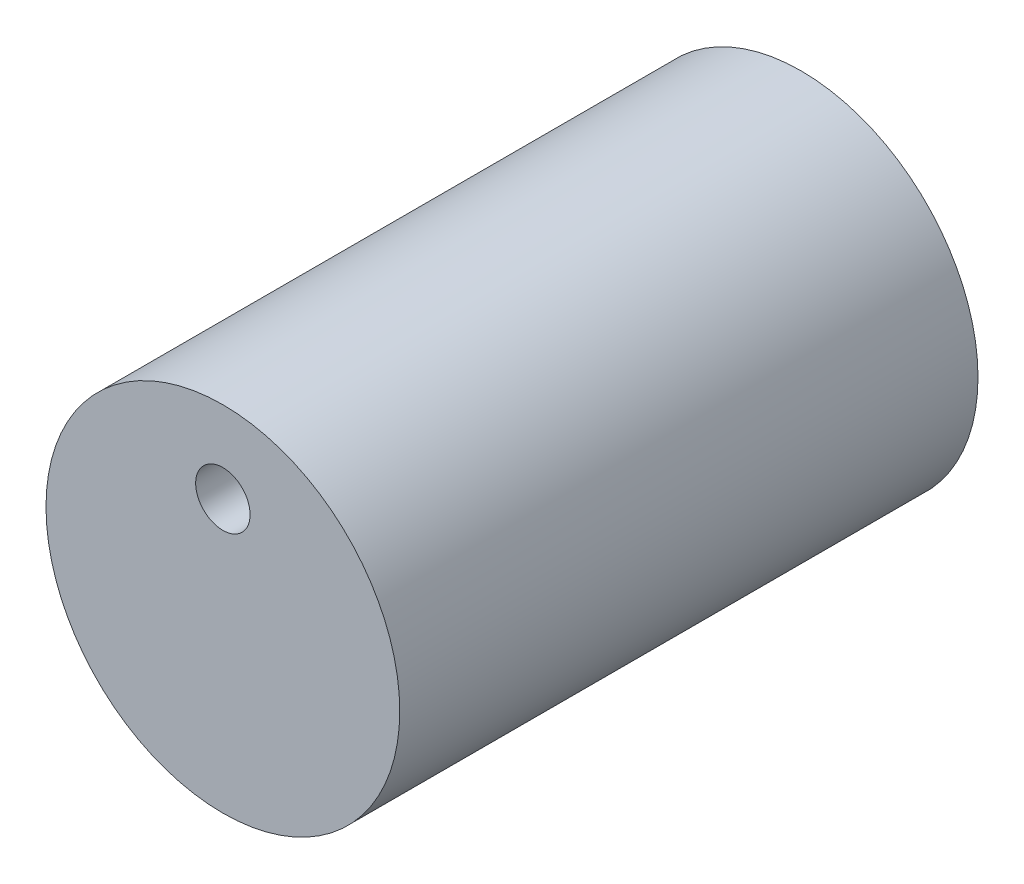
from build123d import *

# Parameters (mm, degrees)
SKETCH_1_R          = 13
EXTRUDE_1_DEPTH     = 42.5
SKETCH_2_R          = 2
CUT_EXTRUDE_1_DEPTH = 4.7
SKETCH_3_R          = 1.5
CUT_EXTRUDE_2_DEPTH = 4


with BuildPart() as part:
    # Sketch 1 → Extrude 1 (new body)
    with BuildSketch(Plane.XY):
        Circle(SKETCH_1_R)
    extrude(amount=EXTRUDE_1_DEPTH)

    # Sketch 2 → Cut-Extrude 1 (cut)
    with BuildSketch(Plane.XY.offset(42.5)):
        with Locations((0, 7)):
            Circle(SKETCH_2_R)
    extrude(amount=-CUT_EXTRUDE_1_DEPTH, mode=Mode.SUBTRACT)

    # Sketch 3 → Cut-Extrude 2 (cut)
    with BuildSketch(Plane(origin=(0, 0, 0), x_dir=(-1, 0, 0), z_dir=(0, 0, -1))):
        with Locations((0, 6)):
            Circle(SKETCH_3_R)
    extrude(amount=-CUT_EXTRUDE_2_DEPTH, mode=Mode.SUBTRACT)


solid = part.part
